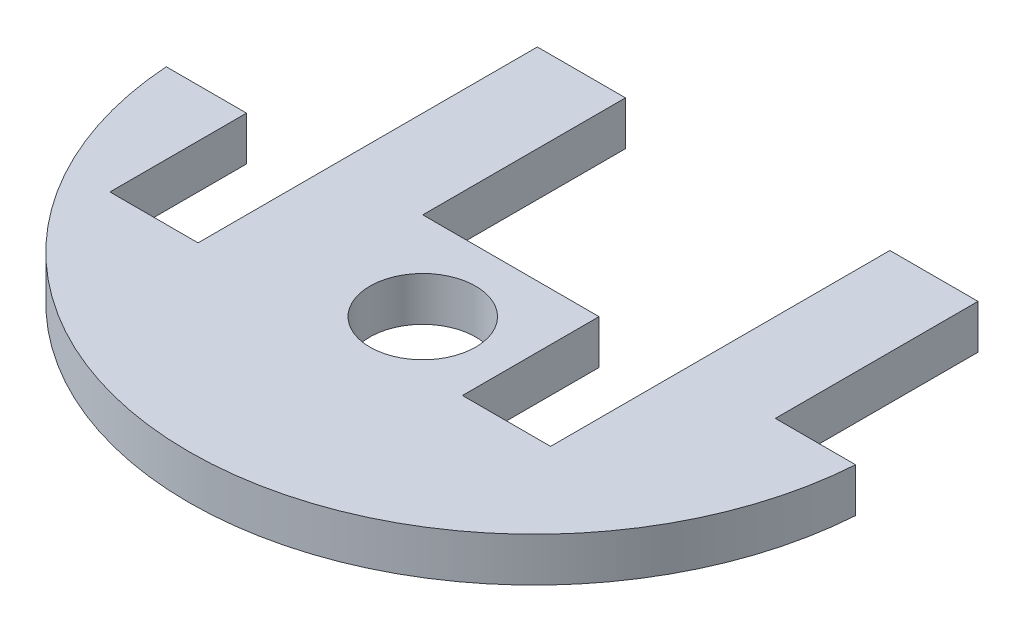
ISO-10303-21;
HEADER;
FILE_DESCRIPTION(('STEP AP214'),'2;1');
FILE_NAME('part.step','',(''),(''),'','','');
FILE_SCHEMA(('AUTOMOTIVE_DESIGN { 1 0 10303 214 1 1 1 1 }'));
ENDSEC;
DATA;
#1=APPLICATION_CONTEXT('core data for automotive mechanical design processes');
#2=APPLICATION_PROTOCOL_DEFINITION('international standard','automotive_design',2000,#1);
#3=PRODUCT_CONTEXT('',#1,'mechanical');
#4=PRODUCT('Part','Part','',(#3));
#5=PRODUCT_RELATED_PRODUCT_CATEGORY('part','',(#4));
#6=PRODUCT_DEFINITION_FORMATION('','',#4);
#7=PRODUCT_DEFINITION_CONTEXT('part definition',#1,'design');
#8=PRODUCT_DEFINITION('design','',#6,#7);
#9=PRODUCT_DEFINITION_SHAPE('','',#8);
#10=(LENGTH_UNIT() NAMED_UNIT(*) SI_UNIT(.MILLI.,.METRE.));
#11=(NAMED_UNIT(*) PLANE_ANGLE_UNIT() SI_UNIT($,.RADIAN.));
#12=(NAMED_UNIT(*) SI_UNIT($,.STERADIAN.) SOLID_ANGLE_UNIT());
#13=UNCERTAINTY_MEASURE_WITH_UNIT(LENGTH_MEASURE(1.E-05),#10,'distance_accuracy_value','');
#14=(GEOMETRIC_REPRESENTATION_CONTEXT(3) GLOBAL_UNCERTAINTY_ASSIGNED_CONTEXT((#13)) GLOBAL_UNIT_ASSIGNED_CONTEXT((#10,
#11,#12)) REPRESENTATION_CONTEXT('',''));
#15=CARTESIAN_POINT('',(0.,0.,0.));
#16=DIRECTION('',(0.,0.,1.));
#17=DIRECTION('',(1.,0.,0.));
#18=AXIS2_PLACEMENT_3D('',#15,#16,#17);
#19=CARTESIAN_POINT('',(-30.9047814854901,0.,1.6891));
#20=DIRECTION('',(0.,0.,1.));
#21=DIRECTION('',(1.,0.,0.));
#22=AXIS2_PLACEMENT_3D('',#19,#20,#21);
#23=PLANE('',#22);
#24=DIRECTION('',(1.,0.,0.));
#25=VECTOR('',#24,1.);
#26=CARTESIAN_POINT('',(-30.9047814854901,3.175,1.6891));
#27=LINE('',#26,#25);
#28=CARTESIAN_POINT('',(-6.35,3.175,1.6891));
#29=VERTEX_POINT('',#28);
#30=CARTESIAN_POINT('',(6.34999999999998,3.175,1.6891));
#31=VERTEX_POINT('',#30);
#32=EDGE_CURVE('E163',#29,#31,#27,.T.);
#33=ORIENTED_EDGE('',*,*,#32,.T.);
#34=DIRECTION('',(0.,1.,0.));
#35=VECTOR('',#34,1.);
#36=CARTESIAN_POINT('',(6.34999999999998,0.,1.6891));
#37=LINE('',#36,#35);
#38=CARTESIAN_POINT('',(6.34999999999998,0.,1.6891));
#39=VERTEX_POINT('',#38);
#40=EDGE_CURVE('E149',#39,#31,#37,.T.);
#41=ORIENTED_EDGE('',*,*,#40,.F.);
#42=DIRECTION('',(1.,0.,0.));
#43=VECTOR('',#42,1.);
#44=CARTESIAN_POINT('',(0.,0.,1.6891));
#45=LINE('',#44,#43);
#46=CARTESIAN_POINT('',(-6.35,0.,1.6891));
#47=VERTEX_POINT('',#46);
#48=EDGE_CURVE('E50',#47,#39,#45,.T.);
#49=ORIENTED_EDGE('',*,*,#48,.F.);
#50=DIRECTION('',(0.,1.,0.));
#51=VECTOR('',#50,1.);
#52=CARTESIAN_POINT('',(-6.35,0.,1.6891));
#53=LINE('',#52,#51);
#54=EDGE_CURVE('E217',#47,#29,#53,.T.);
#55=ORIENTED_EDGE('',*,*,#54,.T.);
#56=EDGE_LOOP('',(#33,#41,#49,#55));
#57=FACE_BOUND('',#56,.T.);
#58=ADVANCED_FACE('F41',(#57),#23,.F.);
#59=CARTESIAN_POINT('',(-24.8346251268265,3.175,1.6891));
#60=VERTEX_POINT('',#59);
#61=CARTESIAN_POINT('',(-19.05,3.175,1.6891));
#62=VERTEX_POINT('',#61);
#63=EDGE_CURVE('E190',#60,#62,#27,.T.);
#64=ORIENTED_EDGE('',*,*,#63,.T.);
#65=DIRECTION('',(0.,1.,0.));
#66=VECTOR('',#65,1.);
#67=CARTESIAN_POINT('',(-19.05,0.,1.6891));
#68=LINE('',#67,#66);
#69=CARTESIAN_POINT('',(-19.05,0.,1.6891));
#70=VERTEX_POINT('',#69);
#71=EDGE_CURVE('E256',#70,#62,#68,.T.);
#72=ORIENTED_EDGE('',*,*,#71,.F.);
#73=CARTESIAN_POINT('',(-24.8346251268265,0.,1.6891));
#74=VERTEX_POINT('',#73);
#75=EDGE_CURVE('E11',#74,#70,#45,.T.);
#76=ORIENTED_EDGE('',*,*,#75,.F.);
#77=DIRECTION('',(0.,-1.,0.));
#78=VECTOR('',#77,1.);
#79=CARTESIAN_POINT('',(-24.8346251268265,3.175,1.6891));
#80=LINE('',#79,#78);
#81=EDGE_CURVE('E181',#60,#74,#80,.T.);
#82=ORIENTED_EDGE('',*,*,#81,.F.);
#83=EDGE_LOOP('',(#64,#72,#76,#82));
#84=FACE_BOUND('',#83,.T.);
#85=ADVANCED_FACE('F330',(#84),#23,.F.);
#86=CARTESIAN_POINT('',(0.,3.175,0.));
#87=DIRECTION('',(0.,-1.,0.));
#88=DIRECTION('',(0.,0.,-1.));
#89=AXIS2_PLACEMENT_3D('',#86,#87,#88);
#90=CYLINDRICAL_SURFACE('',#89,24.892);
#91=CARTESIAN_POINT('',(0.,3.175,0.));
#92=DIRECTION('',(0.,1.,0.));
#93=DIRECTION('',(0.,0.,1.));
#94=AXIS2_PLACEMENT_3D('',#91,#92,#93);
#95=CIRCLE('',#94,24.892);
#96=CARTESIAN_POINT('',(24.8346251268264,3.175,1.6891));
#97=VERTEX_POINT('',#96);
#98=EDGE_CURVE('E169',#60,#97,#95,.T.);
#99=ORIENTED_EDGE('',*,*,#98,.F.);
#100=ORIENTED_EDGE('',*,*,#81,.T.);
#101=CARTESIAN_POINT('',(0.,0.,0.));
#102=DIRECTION('',(0.,1.,0.));
#103=DIRECTION('',(0.,0.,1.));
#104=AXIS2_PLACEMENT_3D('',#101,#102,#103);
#105=CIRCLE('',#104,24.892);
#106=CARTESIAN_POINT('',(24.8346251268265,0.,1.6891));
#107=VERTEX_POINT('',#106);
#108=EDGE_CURVE('E174',#74,#107,#105,.T.);
#109=ORIENTED_EDGE('',*,*,#108,.T.);
#110=DIRECTION('',(0.,-1.,0.));
#111=VECTOR('',#110,1.);
#112=CARTESIAN_POINT('',(24.8346251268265,3.175,1.6891));
#113=LINE('',#112,#111);
#114=EDGE_CURVE('E186',#107,#97,#113,.F.);
#115=ORIENTED_EDGE('',*,*,#114,.T.);
#116=EDGE_LOOP('',(#99,#100,#109,#115));
#117=FACE_BOUND('',#116,.T.);
#118=ADVANCED_FACE('F43',(#117),#90,.T.);
#119=CARTESIAN_POINT('',(0.,3.175,0.));
#120=DIRECTION('',(0.,1.,0.));
#121=DIRECTION('',(0.,0.,1.));
#122=AXIS2_PLACEMENT_3D('',#119,#120,#121);
#123=PLANE('',#122);
#124=CARTESIAN_POINT('',(0.,3.175,8.0391));
#125=DIRECTION('',(0.,1.,0.));
#126=DIRECTION('',(0.,0.,1.));
#127=AXIS2_PLACEMENT_3D('',#124,#125,#126);
#128=CIRCLE('',#127,3.81);
#129=CARTESIAN_POINT('',(0.,3.175,11.8491));
#130=VERTEX_POINT('',#129);
#131=EDGE_CURVE('E296',#130,#130,#128,.T.);
#132=ORIENTED_EDGE('',*,*,#131,.F.);
#133=EDGE_LOOP('',(#132));
#134=FACE_BOUND('',#133,.T.);
#135=DIRECTION('',(0.,0.,1.));
#136=VECTOR('',#135,1.);
#137=CARTESIAN_POINT('',(12.7,3.175,1.6891));
#138=LINE('',#137,#136);
#139=CARTESIAN_POINT('',(12.7,3.175,-12.9159));
#140=VERTEX_POINT('',#139);
#141=CARTESIAN_POINT('',(12.7,3.175,11.5316));
#142=VERTEX_POINT('',#141);
#143=EDGE_CURVE('E214',#140,#142,#138,.T.);
#144=ORIENTED_EDGE('',*,*,#143,.T.);
#145=DIRECTION('',(1.,0.,0.));
#146=VECTOR('',#145,1.);
#147=CARTESIAN_POINT('',(12.7,3.175,11.5316));
#148=LINE('',#147,#146);
#149=CARTESIAN_POINT('',(6.34999999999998,3.175,11.5316));
#150=VERTEX_POINT('',#149);
#151=EDGE_CURVE('E156',#150,#142,#148,.T.);
#152=ORIENTED_EDGE('',*,*,#151,.F.);
#153=DIRECTION('',(0.,0.,1.));
#154=VECTOR('',#153,1.);
#155=CARTESIAN_POINT('',(6.34999999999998,3.175,1.6891));
#156=LINE('',#155,#154);
#157=EDGE_CURVE('E267',#31,#150,#156,.T.);
#158=ORIENTED_EDGE('',*,*,#157,.F.);
#159=ORIENTED_EDGE('',*,*,#32,.F.);
#160=DIRECTION('',(0.,0.,-1.));
#161=VECTOR('',#160,1.);
#162=CARTESIAN_POINT('',(-6.35,3.175,1.6891));
#163=LINE('',#162,#161);
#164=CARTESIAN_POINT('',(-6.35,3.175,-12.9159));
#165=VERTEX_POINT('',#164);
#166=EDGE_CURVE('E243',#29,#165,#163,.T.);
#167=ORIENTED_EDGE('',*,*,#166,.T.);
#168=DIRECTION('',(-1.,0.,0.));
#169=VECTOR('',#168,1.);
#170=CARTESIAN_POINT('',(-6.35,3.175,-12.9159));
#171=LINE('',#170,#169);
#172=CARTESIAN_POINT('',(-12.7,3.175,-12.9159));
#173=VERTEX_POINT('',#172);
#174=EDGE_CURVE('E239',#165,#173,#171,.T.);
#175=ORIENTED_EDGE('',*,*,#174,.T.);
#176=DIRECTION('',(0.,0.,1.));
#177=VECTOR('',#176,1.);
#178=CARTESIAN_POINT('',(-12.7,3.175,1.6891));
#179=LINE('',#178,#177);
#180=CARTESIAN_POINT('',(-12.7,3.175,11.5316));
#181=VERTEX_POINT('',#180);
#182=EDGE_CURVE('E236',#173,#181,#179,.T.);
#183=ORIENTED_EDGE('',*,*,#182,.T.);
#184=DIRECTION('',(1.,0.,0.));
#185=VECTOR('',#184,1.);
#186=CARTESIAN_POINT('',(-12.7,3.175,11.5316));
#187=LINE('',#186,#185);
#188=CARTESIAN_POINT('',(-19.05,3.175,11.5316));
#189=VERTEX_POINT('',#188);
#190=EDGE_CURVE('E268',#189,#181,#187,.T.);
#191=ORIENTED_EDGE('',*,*,#190,.F.);
#192=DIRECTION('',(0.,0.,1.));
#193=VECTOR('',#192,1.);
#194=CARTESIAN_POINT('',(-19.05,3.175,1.6891));
#195=LINE('',#194,#193);
#196=EDGE_CURVE('E273',#62,#189,#195,.T.);
#197=ORIENTED_EDGE('',*,*,#196,.F.);
#198=ORIENTED_EDGE('',*,*,#63,.F.);
#199=ORIENTED_EDGE('',*,*,#98,.T.);
#200=CARTESIAN_POINT('',(19.05,3.175,1.6891));
#201=VERTEX_POINT('',#200);
#202=EDGE_CURVE('E194',#201,#97,#27,.T.);
#203=ORIENTED_EDGE('',*,*,#202,.F.);
#204=DIRECTION('',(0.,0.,-1.));
#205=VECTOR('',#204,1.);
#206=CARTESIAN_POINT('',(19.05,3.175,1.6891));
#207=LINE('',#206,#205);
#208=CARTESIAN_POINT('',(19.05,3.175,-12.9159));
#209=VERTEX_POINT('',#208);
#210=EDGE_CURVE('E210',#201,#209,#207,.T.);
#211=ORIENTED_EDGE('',*,*,#210,.T.);
#212=DIRECTION('',(-1.,0.,0.));
#213=VECTOR('',#212,1.);
#214=CARTESIAN_POINT('',(12.7,3.175,-12.9159));
#215=LINE('',#214,#213);
#216=EDGE_CURVE('E205',#209,#140,#215,.T.);
#217=ORIENTED_EDGE('',*,*,#216,.T.);
#218=EDGE_LOOP('',(#144,#152,#158,#159,#167,#175,#183,#191,#197,#198,#199,#203,#211,#217));
#219=FACE_BOUND('',#218,.T.);
#220=ADVANCED_FACE('F311',(#134,#219),#123,.T.);
#221=CARTESIAN_POINT('',(0.,0.,0.));
#222=DIRECTION('',(0.,1.,0.));
#223=DIRECTION('',(0.,0.,1.));
#224=AXIS2_PLACEMENT_3D('',#221,#222,#223);
#225=PLANE('',#224);
#226=CARTESIAN_POINT('',(0.,0.,8.0391));
#227=DIRECTION('',(0.,1.,0.));
#228=DIRECTION('',(0.,0.,1.));
#229=AXIS2_PLACEMENT_3D('',#226,#227,#228);
#230=CIRCLE('',#229,3.81);
#231=CARTESIAN_POINT('',(0.,0.,11.8491));
#232=VERTEX_POINT('',#231);
#233=EDGE_CURVE('E277',#232,#232,#230,.T.);
#234=ORIENTED_EDGE('',*,*,#233,.T.);
#235=EDGE_LOOP('',(#234));
#236=FACE_BOUND('',#235,.T.);
#237=DIRECTION('',(1.,0.,0.));
#238=VECTOR('',#237,1.);
#239=CARTESIAN_POINT('',(12.7,0.,11.5316));
#240=LINE('',#239,#238);
#241=CARTESIAN_POINT('',(6.34999999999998,0.,11.5316));
#242=VERTEX_POINT('',#241);
#243=CARTESIAN_POINT('',(12.7,0.,11.5316));
#244=VERTEX_POINT('',#243);
#245=EDGE_CURVE('E155',#242,#244,#240,.T.);
#246=ORIENTED_EDGE('',*,*,#245,.T.);
#247=DIRECTION('',(0.,0.,1.));
#248=VECTOR('',#247,1.);
#249=CARTESIAN_POINT('',(12.7,0.,1.6891));
#250=LINE('',#249,#248);
#251=CARTESIAN_POINT('',(12.7,0.,-12.9159));
#252=VERTEX_POINT('',#251);
#253=EDGE_CURVE('E209',#252,#244,#250,.T.);
#254=ORIENTED_EDGE('',*,*,#253,.F.);
#255=DIRECTION('',(-1.,0.,0.));
#256=VECTOR('',#255,1.);
#257=CARTESIAN_POINT('',(12.7,0.,-12.9159));
#258=LINE('',#257,#256);
#259=CARTESIAN_POINT('',(19.05,0.,-12.9159));
#260=VERTEX_POINT('',#259);
#261=EDGE_CURVE('E199',#260,#252,#258,.T.);
#262=ORIENTED_EDGE('',*,*,#261,.F.);
#263=DIRECTION('',(0.,0.,-1.));
#264=VECTOR('',#263,1.);
#265=CARTESIAN_POINT('',(19.05,0.,1.6891));
#266=LINE('',#265,#264);
#267=CARTESIAN_POINT('',(19.05,0.,1.6891));
#268=VERTEX_POINT('',#267);
#269=EDGE_CURVE('E221',#268,#260,#266,.T.);
#270=ORIENTED_EDGE('',*,*,#269,.F.);
#271=EDGE_CURVE('E51',#268,#107,#45,.T.);
#272=ORIENTED_EDGE('',*,*,#271,.T.);
#273=ORIENTED_EDGE('',*,*,#108,.F.);
#274=ORIENTED_EDGE('',*,*,#75,.T.);
#275=DIRECTION('',(0.,0.,1.));
#276=VECTOR('',#275,1.);
#277=CARTESIAN_POINT('',(-19.05,0.,1.6891));
#278=LINE('',#277,#276);
#279=CARTESIAN_POINT('',(-19.05,0.,11.5316));
#280=VERTEX_POINT('',#279);
#281=EDGE_CURVE('E272',#70,#280,#278,.T.);
#282=ORIENTED_EDGE('',*,*,#281,.T.);
#283=DIRECTION('',(1.,0.,0.));
#284=VECTOR('',#283,1.);
#285=CARTESIAN_POINT('',(-12.7,0.,11.5316));
#286=LINE('',#285,#284);
#287=CARTESIAN_POINT('',(-12.7,0.,11.5316));
#288=VERTEX_POINT('',#287);
#289=EDGE_CURVE('E260',#280,#288,#286,.T.);
#290=ORIENTED_EDGE('',*,*,#289,.T.);
#291=DIRECTION('',(0.,0.,1.));
#292=VECTOR('',#291,1.);
#293=CARTESIAN_POINT('',(-12.7,0.,1.6891));
#294=LINE('',#293,#292);
#295=CARTESIAN_POINT('',(-12.7,0.,-12.9159));
#296=VERTEX_POINT('',#295);
#297=EDGE_CURVE('E231',#296,#288,#294,.T.);
#298=ORIENTED_EDGE('',*,*,#297,.F.);
#299=DIRECTION('',(-1.,0.,0.));
#300=VECTOR('',#299,1.);
#301=CARTESIAN_POINT('',(-6.35,0.,-12.9159));
#302=LINE('',#301,#300);
#303=CARTESIAN_POINT('',(-6.35,0.,-12.9159));
#304=VERTEX_POINT('',#303);
#305=EDGE_CURVE('E250',#304,#296,#302,.T.);
#306=ORIENTED_EDGE('',*,*,#305,.F.);
#307=DIRECTION('',(0.,0.,-1.));
#308=VECTOR('',#307,1.);
#309=CARTESIAN_POINT('',(-6.35,0.,1.6891));
#310=LINE('',#309,#308);
#311=EDGE_CURVE('E58',#47,#304,#310,.T.);
#312=ORIENTED_EDGE('',*,*,#311,.F.);
#313=ORIENTED_EDGE('',*,*,#48,.T.);
#314=DIRECTION('',(0.,0.,1.));
#315=VECTOR('',#314,1.);
#316=CARTESIAN_POINT('',(6.34999999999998,0.,1.6891));
#317=LINE('',#316,#315);
#318=EDGE_CURVE('E145',#39,#242,#317,.T.);
#319=ORIENTED_EDGE('',*,*,#318,.T.);
#320=EDGE_LOOP('',(#246,#254,#262,#270,#272,#273,#274,#282,#290,#298,#306,#312,#313,#319));
#321=FACE_BOUND('',#320,.T.);
#322=ADVANCED_FACE('F166',(#236,#321),#225,.F.);
#323=ORIENTED_EDGE('',*,*,#271,.F.);
#324=DIRECTION('',(0.,1.,0.));
#325=VECTOR('',#324,1.);
#326=CARTESIAN_POINT('',(19.05,0.,1.6891));
#327=LINE('',#326,#325);
#328=EDGE_CURVE('E195',#268,#201,#327,.T.);
#329=ORIENTED_EDGE('',*,*,#328,.T.);
#330=ORIENTED_EDGE('',*,*,#202,.T.);
#331=ORIENTED_EDGE('',*,*,#114,.F.);
#332=EDGE_LOOP('',(#323,#329,#330,#331));
#333=FACE_BOUND('',#332,.T.);
#334=ADVANCED_FACE('F325',(#333),#23,.F.);
#335=CARTESIAN_POINT('',(12.7,0.,1.6891));
#336=DIRECTION('',(-1.,0.,0.));
#337=DIRECTION('',(0.,0.,1.));
#338=AXIS2_PLACEMENT_3D('',#335,#336,#337);
#339=PLANE('',#338);
#340=ORIENTED_EDGE('',*,*,#143,.F.);
#341=DIRECTION('',(0.,1.,0.));
#342=VECTOR('',#341,1.);
#343=CARTESIAN_POINT('',(12.7,0.,-12.9159));
#344=LINE('',#343,#342);
#345=EDGE_CURVE('E202',#252,#140,#344,.T.);
#346=ORIENTED_EDGE('',*,*,#345,.F.);
#347=ORIENTED_EDGE('',*,*,#253,.T.);
#348=DIRECTION('',(0.,1.,0.));
#349=VECTOR('',#348,1.);
#350=CARTESIAN_POINT('',(12.7,0.,11.5316));
#351=LINE('',#350,#349);
#352=EDGE_CURVE('E247',#244,#142,#351,.T.);
#353=ORIENTED_EDGE('',*,*,#352,.T.);
#354=EDGE_LOOP('',(#340,#346,#347,#353));
#355=FACE_BOUND('',#354,.T.);
#356=ADVANCED_FACE('F319',(#355),#339,.T.);
#357=CARTESIAN_POINT('',(12.7,0.,-12.9159));
#358=DIRECTION('',(0.,0.,-1.));
#359=DIRECTION('',(-1.,0.,0.));
#360=AXIS2_PLACEMENT_3D('',#357,#358,#359);
#361=PLANE('',#360);
#362=ORIENTED_EDGE('',*,*,#216,.F.);
#363=DIRECTION('',(0.,1.,0.));
#364=VECTOR('',#363,1.);
#365=CARTESIAN_POINT('',(19.05,0.,-12.9159));
#366=LINE('',#365,#364);
#367=EDGE_CURVE('E198',#260,#209,#366,.T.);
#368=ORIENTED_EDGE('',*,*,#367,.F.);
#369=ORIENTED_EDGE('',*,*,#261,.T.);
#370=ORIENTED_EDGE('',*,*,#345,.T.);
#371=EDGE_LOOP('',(#362,#368,#369,#370));
#372=FACE_BOUND('',#371,.T.);
#373=ADVANCED_FACE('F356',(#372),#361,.T.);
#374=CARTESIAN_POINT('',(19.05,0.,1.6891));
#375=DIRECTION('',(1.,0.,0.));
#376=DIRECTION('',(0.,0.,-1.));
#377=AXIS2_PLACEMENT_3D('',#374,#375,#376);
#378=PLANE('',#377);
#379=ORIENTED_EDGE('',*,*,#210,.F.);
#380=ORIENTED_EDGE('',*,*,#328,.F.);
#381=ORIENTED_EDGE('',*,*,#269,.T.);
#382=ORIENTED_EDGE('',*,*,#367,.T.);
#383=EDGE_LOOP('',(#379,#380,#381,#382));
#384=FACE_BOUND('',#383,.T.);
#385=ADVANCED_FACE('F349',(#384),#378,.T.);
#386=CARTESIAN_POINT('',(-6.35,0.,1.6891));
#387=DIRECTION('',(1.,0.,0.));
#388=DIRECTION('',(0.,0.,-1.));
#389=AXIS2_PLACEMENT_3D('',#386,#387,#388);
#390=PLANE('',#389);
#391=ORIENTED_EDGE('',*,*,#166,.F.);
#392=ORIENTED_EDGE('',*,*,#54,.F.);
#393=ORIENTED_EDGE('',*,*,#311,.T.);
#394=DIRECTION('',(0.,1.,0.));
#395=VECTOR('',#394,1.);
#396=CARTESIAN_POINT('',(-6.35,0.,-12.9159));
#397=LINE('',#396,#395);
#398=EDGE_CURVE('E227',#304,#165,#397,.T.);
#399=ORIENTED_EDGE('',*,*,#398,.T.);
#400=EDGE_LOOP('',(#391,#392,#393,#399));
#401=FACE_BOUND('',#400,.T.);
#402=ADVANCED_FACE('F346',(#401),#390,.T.);
#403=CARTESIAN_POINT('',(-12.7,0.,1.6891));
#404=DIRECTION('',(-1.,0.,0.));
#405=DIRECTION('',(0.,0.,1.));
#406=AXIS2_PLACEMENT_3D('',#403,#404,#405);
#407=PLANE('',#406);
#408=ORIENTED_EDGE('',*,*,#182,.F.);
#409=DIRECTION('',(0.,1.,0.));
#410=VECTOR('',#409,1.);
#411=CARTESIAN_POINT('',(-12.7,0.,-12.9159));
#412=LINE('',#411,#410);
#413=EDGE_CURVE('E230',#296,#173,#412,.T.);
#414=ORIENTED_EDGE('',*,*,#413,.F.);
#415=ORIENTED_EDGE('',*,*,#297,.T.);
#416=DIRECTION('',(0.,1.,0.));
#417=VECTOR('',#416,1.);
#418=CARTESIAN_POINT('',(-12.7,0.,11.5316));
#419=LINE('',#418,#417);
#420=EDGE_CURVE('E263',#288,#181,#419,.T.);
#421=ORIENTED_EDGE('',*,*,#420,.T.);
#422=EDGE_LOOP('',(#408,#414,#415,#421));
#423=FACE_BOUND('',#422,.T.);
#424=ADVANCED_FACE('F348',(#423),#407,.T.);
#425=CARTESIAN_POINT('',(-6.35,0.,-12.9159));
#426=DIRECTION('',(0.,0.,-1.));
#427=DIRECTION('',(-1.,0.,0.));
#428=AXIS2_PLACEMENT_3D('',#425,#426,#427);
#429=PLANE('',#428);
#430=ORIENTED_EDGE('',*,*,#174,.F.);
#431=ORIENTED_EDGE('',*,*,#398,.F.);
#432=ORIENTED_EDGE('',*,*,#305,.T.);
#433=ORIENTED_EDGE('',*,*,#413,.T.);
#434=EDGE_LOOP('',(#430,#431,#432,#433));
#435=FACE_BOUND('',#434,.T.);
#436=ADVANCED_FACE('F344',(#435),#429,.T.);
#437=CARTESIAN_POINT('',(-12.7,0.,11.5316));
#438=DIRECTION('',(0.,0.,1.));
#439=DIRECTION('',(1.,0.,0.));
#440=AXIS2_PLACEMENT_3D('',#437,#438,#439);
#441=PLANE('',#440);
#442=ORIENTED_EDGE('',*,*,#190,.T.);
#443=ORIENTED_EDGE('',*,*,#420,.F.);
#444=ORIENTED_EDGE('',*,*,#289,.F.);
#445=DIRECTION('',(0.,1.,0.));
#446=VECTOR('',#445,1.);
#447=CARTESIAN_POINT('',(-19.05,0.,11.5316));
#448=LINE('',#447,#446);
#449=EDGE_CURVE('E259',#280,#189,#448,.T.);
#450=ORIENTED_EDGE('',*,*,#449,.T.);
#451=EDGE_LOOP('',(#442,#443,#444,#450));
#452=FACE_BOUND('',#451,.T.);
#453=ADVANCED_FACE('F338',(#452),#441,.F.);
#454=CARTESIAN_POINT('',(-19.05,0.,1.6891));
#455=DIRECTION('',(-1.,0.,0.));
#456=DIRECTION('',(0.,0.,1.));
#457=AXIS2_PLACEMENT_3D('',#454,#455,#456);
#458=PLANE('',#457);
#459=ORIENTED_EDGE('',*,*,#196,.T.);
#460=ORIENTED_EDGE('',*,*,#449,.F.);
#461=ORIENTED_EDGE('',*,*,#281,.F.);
#462=ORIENTED_EDGE('',*,*,#71,.T.);
#463=EDGE_LOOP('',(#459,#460,#461,#462));
#464=FACE_BOUND('',#463,.T.);
#465=ADVANCED_FACE('F333',(#464),#458,.F.);
#466=CARTESIAN_POINT('',(12.7,0.,11.5316));
#467=DIRECTION('',(0.,0.,1.));
#468=DIRECTION('',(1.,0.,0.));
#469=AXIS2_PLACEMENT_3D('',#466,#467,#468);
#470=PLANE('',#469);
#471=ORIENTED_EDGE('',*,*,#151,.T.);
#472=ORIENTED_EDGE('',*,*,#352,.F.);
#473=ORIENTED_EDGE('',*,*,#245,.F.);
#474=DIRECTION('',(0.,1.,0.));
#475=VECTOR('',#474,1.);
#476=CARTESIAN_POINT('',(6.34999999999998,0.,11.5316));
#477=LINE('',#476,#475);
#478=EDGE_CURVE('E151',#242,#150,#477,.T.);
#479=ORIENTED_EDGE('',*,*,#478,.T.);
#480=EDGE_LOOP('',(#471,#472,#473,#479));
#481=FACE_BOUND('',#480,.T.);
#482=ADVANCED_FACE('F322',(#481),#470,.F.);
#483=CARTESIAN_POINT('',(6.34999999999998,0.,1.6891));
#484=DIRECTION('',(-1.,0.,0.));
#485=DIRECTION('',(0.,0.,1.));
#486=AXIS2_PLACEMENT_3D('',#483,#484,#485);
#487=PLANE('',#486);
#488=ORIENTED_EDGE('',*,*,#157,.T.);
#489=ORIENTED_EDGE('',*,*,#478,.F.);
#490=ORIENTED_EDGE('',*,*,#318,.F.);
#491=ORIENTED_EDGE('',*,*,#40,.T.);
#492=EDGE_LOOP('',(#488,#489,#490,#491));
#493=FACE_BOUND('',#492,.T.);
#494=ADVANCED_FACE('F148',(#493),#487,.F.);
#495=CARTESIAN_POINT('',(0.,0.,8.0391));
#496=DIRECTION('',(0.,1.,0.));
#497=DIRECTION('',(0.,0.,1.));
#498=AXIS2_PLACEMENT_3D('',#495,#496,#497);
#499=CYLINDRICAL_SURFACE('',#498,3.81);
#500=ORIENTED_EDGE('',*,*,#233,.F.);
#501=EDGE_LOOP('',(#500));
#502=FACE_BOUND('',#501,.T.);
#503=ORIENTED_EDGE('',*,*,#131,.T.);
#504=EDGE_LOOP('',(#503));
#505=FACE_BOUND('',#504,.T.);
#506=ADVANCED_FACE('F305',(#502,#505),#499,.F.);
#507=CLOSED_SHELL('',(#58,#85,#118,#220,#322,#334,#356,#373,#385,#402,#424,#436,#453,#465,#482,
#494,#506));
#508=MANIFOLD_SOLID_BREP('B2',#507);
#509=ADVANCED_BREP_SHAPE_REPRESENTATION('',(#18,#508),#14);
#510=SHAPE_DEFINITION_REPRESENTATION(#9,#509);
ENDSEC;
END-ISO-10303-21;
